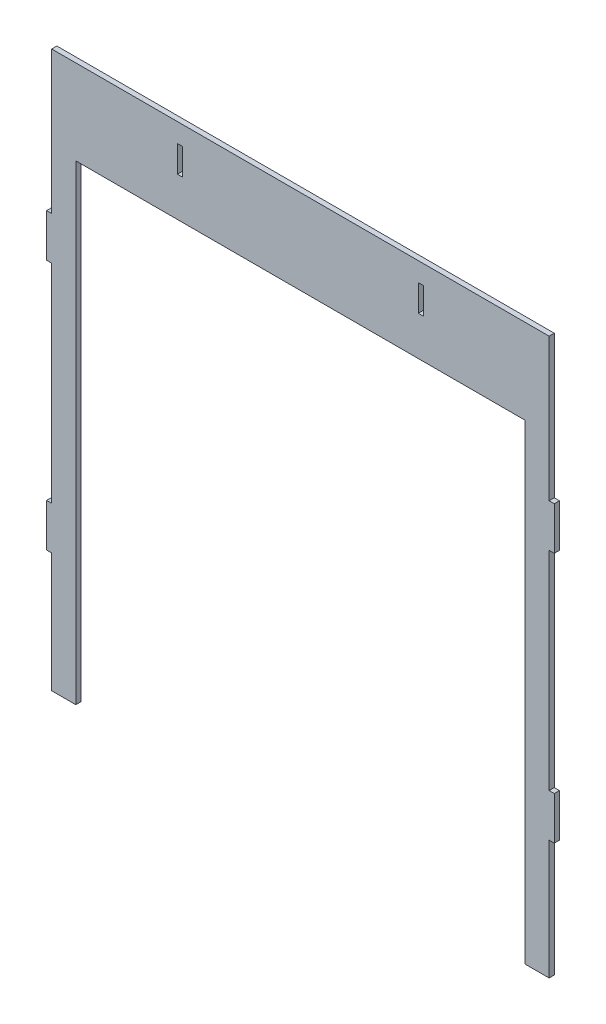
from build123d import *

# Parameters (mm, degrees)
BOSS_EXTRUDE1_DEPTH = 1.524
SKETCH2_W           = 1.524
SKETCH2_H           = 7.864903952
CUT_EXTRUDE1_DEPTH  = 1.524


with BuildPart() as part:
    # Sketch1 → Boss-Extrude1 (new body)
    with BuildSketch(Plane.XY):
        Polygon((0, 61.168836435), (1.524, 61.168836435), (1.524, 48.468836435), (0, 48.468836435), (0, 13.198877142), (-7.119548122, 13.198877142), (-7.119548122, 152.387429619), (-139.865695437, 152.387429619), (-139.865695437, 13.198877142), (-146.985243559, 13.198877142), (-146.985243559, 48.468836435), (-148.509243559, 48.468836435), (-148.509243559, 61.168836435), (-146.985243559, 61.168836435), (-146.985243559, 122.630588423), (-148.509243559, 122.630588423), (-148.509243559, 135.330588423), (-146.985243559, 135.330588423), (-146.985243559, 177.453164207), (0, 177.453164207), (0, 135.330588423), (1.524, 135.330588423), (1.524, 122.630588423), (0, 122.630588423), align=None)
    extrude(amount=BOSS_EXTRUDE1_DEPTH)

    # Sketch2 → Cut-Extrude1 (cut)
    with BuildSketch(Plane.XY.offset(1.524)):
        with Locations((-37.907818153, 167.908727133)):
            Rectangle(SKETCH2_W, SKETCH2_H)
        with Locations((-109.077425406, 167.908727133)):
            Rectangle(SKETCH2_W, SKETCH2_H)
    extrude(amount=-CUT_EXTRUDE1_DEPTH, mode=Mode.SUBTRACT)


solid = part.part
